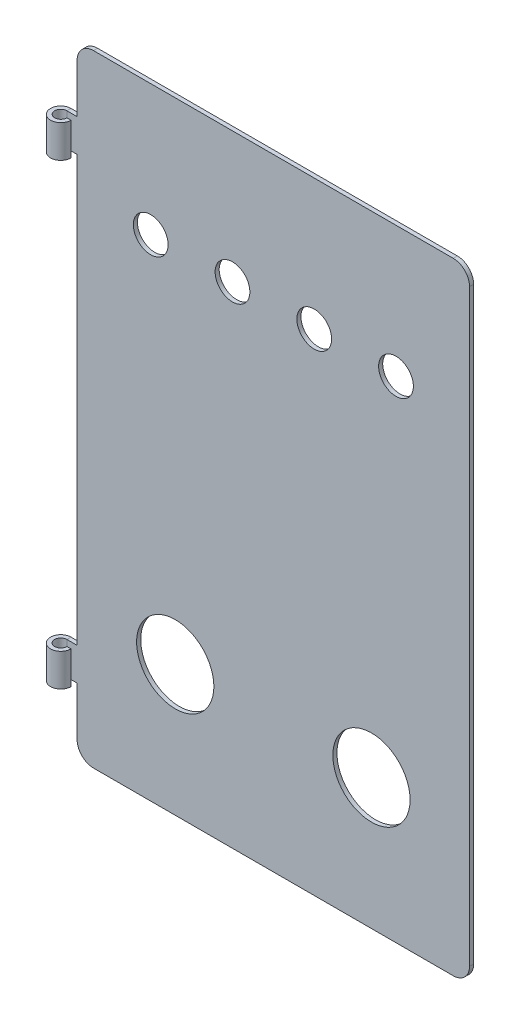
ISO-10303-21;
HEADER;
FILE_DESCRIPTION(('STEP AP214'),'2;1');
FILE_NAME('part.step','',(''),(''),'','','');
FILE_SCHEMA(('AUTOMOTIVE_DESIGN { 1 0 10303 214 1 1 1 1 }'));
ENDSEC;
DATA;
#1=APPLICATION_CONTEXT('core data for automotive mechanical design processes');
#2=APPLICATION_PROTOCOL_DEFINITION('international standard','automotive_design',2000,#1);
#3=PRODUCT_CONTEXT('',#1,'mechanical');
#4=PRODUCT('Part','Part','',(#3));
#5=PRODUCT_RELATED_PRODUCT_CATEGORY('part','',(#4));
#6=PRODUCT_DEFINITION_FORMATION('','',#4);
#7=PRODUCT_DEFINITION_CONTEXT('part definition',#1,'design');
#8=PRODUCT_DEFINITION('design','',#6,#7);
#9=PRODUCT_DEFINITION_SHAPE('','',#8);
#10=(LENGTH_UNIT() NAMED_UNIT(*) SI_UNIT(.MILLI.,.METRE.));
#11=(NAMED_UNIT(*) PLANE_ANGLE_UNIT() SI_UNIT($,.RADIAN.));
#12=(NAMED_UNIT(*) SI_UNIT($,.STERADIAN.) SOLID_ANGLE_UNIT());
#13=UNCERTAINTY_MEASURE_WITH_UNIT(LENGTH_MEASURE(1.E-05),#10,'distance_accuracy_value','');
#14=(GEOMETRIC_REPRESENTATION_CONTEXT(3) GLOBAL_UNCERTAINTY_ASSIGNED_CONTEXT((#13)) GLOBAL_UNIT_ASSIGNED_CONTEXT((#10,
#11,#12)) REPRESENTATION_CONTEXT('',''));
#15=CARTESIAN_POINT('',(0.,0.,0.));
#16=DIRECTION('',(0.,0.,1.));
#17=DIRECTION('',(1.,0.,0.));
#18=AXIS2_PLACEMENT_3D('',#15,#16,#17);
#19=CARTESIAN_POINT('',(-76.2000000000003,-120.65,1.5875));
#20=DIRECTION('',(1.,0.,0.));
#21=DIRECTION('',(0.,0.,-1.));
#22=AXIS2_PLACEMENT_3D('',#19,#20,#21);
#23=PLANE('',#22);
#24=DIRECTION('',(0.,-1.,0.));
#25=VECTOR('',#24,1.);
#26=CARTESIAN_POINT('',(-76.2000000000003,-120.65,1.5875));
#27=LINE('',#26,#25);
#28=CARTESIAN_POINT('',(-76.2000000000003,-95.2500000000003,1.5875));
#29=VERTEX_POINT('',#28);
#30=CARTESIAN_POINT('',(-76.2000000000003,-114.3,1.5875));
#31=VERTEX_POINT('',#30);
#32=EDGE_CURVE('E52',#29,#31,#27,.T.);
#33=ORIENTED_EDGE('',*,*,#32,.F.);
#34=DIRECTION('',(0.,0.,1.));
#35=VECTOR('',#34,1.);
#36=CARTESIAN_POINT('',(-76.2000000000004,-95.2500000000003,0.));
#37=LINE('',#36,#35);
#38=CARTESIAN_POINT('',(-76.2000000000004,-95.2500000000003,0.));
#39=VERTEX_POINT('',#38);
#40=EDGE_CURVE('E251',#39,#29,#37,.T.);
#41=ORIENTED_EDGE('',*,*,#40,.F.);
#42=DIRECTION('',(0.,-1.,0.));
#43=VECTOR('',#42,1.);
#44=CARTESIAN_POINT('',(-76.2000000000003,-120.65,0.));
#45=LINE('',#44,#43);
#46=CARTESIAN_POINT('',(-76.2000000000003,-114.3,0.));
#47=VERTEX_POINT('',#46);
#48=EDGE_CURVE('E307',#39,#47,#45,.T.);
#49=ORIENTED_EDGE('',*,*,#48,.T.);
#50=DIRECTION('',(0.,0.,-1.));
#51=VECTOR('',#50,1.);
#52=CARTESIAN_POINT('',(-76.2000000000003,-114.3,1.5875));
#53=LINE('',#52,#51);
#54=EDGE_CURVE('E342',#47,#31,#53,.F.);
#55=ORIENTED_EDGE('',*,*,#54,.T.);
#56=EDGE_LOOP('',(#33,#41,#49,#55));
#57=FACE_BOUND('',#56,.T.);
#58=ADVANCED_FACE('F37',(#57),#23,.F.);
#59=CARTESIAN_POINT('',(-76.2000000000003,82.5500000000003,0.));
#60=VERTEX_POINT('',#59);
#61=CARTESIAN_POINT('',(-76.2000000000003,-82.5500000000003,0.));
#62=VERTEX_POINT('',#61);
#63=EDGE_CURVE('E310',#60,#62,#45,.T.);
#64=ORIENTED_EDGE('',*,*,#63,.T.);
#65=DIRECTION('',(0.,0.,1.));
#66=VECTOR('',#65,1.);
#67=CARTESIAN_POINT('',(-76.2000000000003,-82.5500000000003,0.));
#68=LINE('',#67,#66);
#69=CARTESIAN_POINT('',(-76.2000000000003,-82.5500000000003,1.5875));
#70=VERTEX_POINT('',#69);
#71=EDGE_CURVE('E60',#62,#70,#68,.T.);
#72=ORIENTED_EDGE('',*,*,#71,.T.);
#73=CARTESIAN_POINT('',(-76.2000000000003,82.5500000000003,1.5875));
#74=VERTEX_POINT('',#73);
#75=EDGE_CURVE('E298',#74,#70,#27,.T.);
#76=ORIENTED_EDGE('',*,*,#75,.F.);
#77=DIRECTION('',(0.,0.,1.));
#78=VECTOR('',#77,1.);
#79=CARTESIAN_POINT('',(-76.2000000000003,82.5500000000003,0.));
#80=LINE('',#79,#78);
#81=EDGE_CURVE('E277',#60,#74,#80,.T.);
#82=ORIENTED_EDGE('',*,*,#81,.F.);
#83=EDGE_LOOP('',(#64,#72,#76,#82));
#84=FACE_BOUND('',#83,.T.);
#85=ADVANCED_FACE('F393',(#84),#23,.F.);
#86=CARTESIAN_POINT('',(76.2000000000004,-120.65,1.5875));
#87=DIRECTION('',(-1.,0.,0.));
#88=DIRECTION('',(0.,0.,1.));
#89=AXIS2_PLACEMENT_3D('',#86,#87,#88);
#90=PLANE('',#89);
#91=DIRECTION('',(0.,1.,0.));
#92=VECTOR('',#91,1.);
#93=CARTESIAN_POINT('',(76.2000000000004,-120.65,1.5875));
#94=LINE('',#93,#92);
#95=CARTESIAN_POINT('',(76.2000000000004,-114.3,1.5875));
#96=VERTEX_POINT('',#95);
#97=CARTESIAN_POINT('',(76.2000000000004,114.3,1.5875));
#98=VERTEX_POINT('',#97);
#99=EDGE_CURVE('E287',#96,#98,#94,.T.);
#100=ORIENTED_EDGE('',*,*,#99,.F.);
#101=DIRECTION('',(0.,0.,-1.));
#102=VECTOR('',#101,1.);
#103=CARTESIAN_POINT('',(76.2000000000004,-114.3,1.5875));
#104=LINE('',#103,#102);
#105=CARTESIAN_POINT('',(76.2000000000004,-114.3,0.));
#106=VERTEX_POINT('',#105);
#107=EDGE_CURVE('E314',#96,#106,#104,.T.);
#108=ORIENTED_EDGE('',*,*,#107,.T.);
#109=DIRECTION('',(0.,1.,0.));
#110=VECTOR('',#109,1.);
#111=CARTESIAN_POINT('',(76.2000000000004,-120.65,0.));
#112=LINE('',#111,#110);
#113=CARTESIAN_POINT('',(76.2000000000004,114.3,0.));
#114=VERTEX_POINT('',#113);
#115=EDGE_CURVE('E280',#106,#114,#112,.T.);
#116=ORIENTED_EDGE('',*,*,#115,.T.);
#117=DIRECTION('',(0.,0.,-1.));
#118=VECTOR('',#117,1.);
#119=CARTESIAN_POINT('',(76.2000000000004,114.3,1.5875));
#120=LINE('',#119,#118);
#121=EDGE_CURVE('E301',#114,#98,#120,.F.);
#122=ORIENTED_EDGE('',*,*,#121,.T.);
#123=EDGE_LOOP('',(#100,#108,#116,#122));
#124=FACE_BOUND('',#123,.T.);
#125=ADVANCED_FACE('F411',(#124),#90,.F.);
#126=CARTESIAN_POINT('',(-76.2000000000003,120.65,1.5875));
#127=DIRECTION('',(0.,-1.,0.));
#128=DIRECTION('',(0.,0.,-1.));
#129=AXIS2_PLACEMENT_3D('',#126,#127,#128);
#130=PLANE('',#129);
#131=DIRECTION('',(-1.,0.,0.));
#132=VECTOR('',#131,1.);
#133=CARTESIAN_POINT('',(-76.2000000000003,120.65,0.));
#134=LINE('',#133,#132);
#135=CARTESIAN_POINT('',(69.8500000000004,120.65,0.));
#136=VERTEX_POINT('',#135);
#137=CARTESIAN_POINT('',(-69.8500000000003,120.65,0.));
#138=VERTEX_POINT('',#137);
#139=EDGE_CURVE('E304',#136,#138,#134,.T.);
#140=ORIENTED_EDGE('',*,*,#139,.T.);
#141=DIRECTION('',(0.,0.,-1.));
#142=VECTOR('',#141,1.);
#143=CARTESIAN_POINT('',(-69.8500000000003,120.65,1.5875));
#144=LINE('',#143,#142);
#145=CARTESIAN_POINT('',(-69.8500000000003,120.65,1.5875));
#146=VERTEX_POINT('',#145);
#147=EDGE_CURVE('E11',#138,#146,#144,.F.);
#148=ORIENTED_EDGE('',*,*,#147,.T.);
#149=DIRECTION('',(-1.,0.,0.));
#150=VECTOR('',#149,1.);
#151=CARTESIAN_POINT('',(-76.2000000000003,120.65,1.5875));
#152=LINE('',#151,#150);
#153=CARTESIAN_POINT('',(69.8500000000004,120.65,1.5875));
#154=VERTEX_POINT('',#153);
#155=EDGE_CURVE('E290',#154,#146,#152,.T.);
#156=ORIENTED_EDGE('',*,*,#155,.F.);
#157=DIRECTION('',(0.,0.,-1.));
#158=VECTOR('',#157,1.);
#159=CARTESIAN_POINT('',(69.8500000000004,120.65,1.5875));
#160=LINE('',#159,#158);
#161=EDGE_CURVE('E45',#154,#136,#160,.T.);
#162=ORIENTED_EDGE('',*,*,#161,.T.);
#163=EDGE_LOOP('',(#140,#148,#156,#162));
#164=FACE_BOUND('',#163,.T.);
#165=ADVANCED_FACE('F348',(#164),#130,.F.);
#166=CARTESIAN_POINT('',(-76.2000000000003,114.3,0.));
#167=VERTEX_POINT('',#166);
#168=CARTESIAN_POINT('',(-76.2000000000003,95.2500000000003,0.));
#169=VERTEX_POINT('',#168);
#170=EDGE_CURVE('E308',#167,#169,#45,.T.);
#171=ORIENTED_EDGE('',*,*,#170,.T.);
#172=DIRECTION('',(0.,0.,1.));
#173=VECTOR('',#172,1.);
#174=CARTESIAN_POINT('',(-76.2000000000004,95.2500000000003,0.));
#175=LINE('',#174,#173);
#176=CARTESIAN_POINT('',(-76.2000000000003,95.2500000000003,1.5875));
#177=VERTEX_POINT('',#176);
#178=EDGE_CURVE('E269',#169,#177,#175,.T.);
#179=ORIENTED_EDGE('',*,*,#178,.T.);
#180=CARTESIAN_POINT('',(-76.2000000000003,114.3,1.5875));
#181=VERTEX_POINT('',#180);
#182=EDGE_CURVE('E294',#181,#177,#27,.T.);
#183=ORIENTED_EDGE('',*,*,#182,.F.);
#184=DIRECTION('',(0.,0.,-1.));
#185=VECTOR('',#184,1.);
#186=CARTESIAN_POINT('',(-76.2000000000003,114.3,1.5875));
#187=LINE('',#186,#185);
#188=EDGE_CURVE('E339',#181,#167,#187,.T.);
#189=ORIENTED_EDGE('',*,*,#188,.T.);
#190=EDGE_LOOP('',(#171,#179,#183,#189));
#191=FACE_BOUND('',#190,.T.);
#192=ADVANCED_FACE('F363',(#191),#23,.F.);
#193=CARTESIAN_POINT('',(-76.2000000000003,-120.65,1.5875));
#194=DIRECTION('',(0.,1.,0.));
#195=DIRECTION('',(0.,0.,1.));
#196=AXIS2_PLACEMENT_3D('',#193,#194,#195);
#197=PLANE('',#196);
#198=DIRECTION('',(1.,0.,0.));
#199=VECTOR('',#198,1.);
#200=CARTESIAN_POINT('',(-76.2000000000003,-120.65,0.));
#201=LINE('',#200,#199);
#202=CARTESIAN_POINT('',(-69.8500000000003,-120.65,0.));
#203=VERTEX_POINT('',#202);
#204=CARTESIAN_POINT('',(69.8500000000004,-120.65,0.));
#205=VERTEX_POINT('',#204);
#206=EDGE_CURVE('E291',#203,#205,#201,.T.);
#207=ORIENTED_EDGE('',*,*,#206,.T.);
#208=DIRECTION('',(0.,0.,-1.));
#209=VECTOR('',#208,1.);
#210=CARTESIAN_POINT('',(69.8500000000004,-120.65,1.5875));
#211=LINE('',#210,#209);
#212=CARTESIAN_POINT('',(69.8500000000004,-120.65,1.5875));
#213=VERTEX_POINT('',#212);
#214=EDGE_CURVE('E329',#205,#213,#211,.F.);
#215=ORIENTED_EDGE('',*,*,#214,.T.);
#216=DIRECTION('',(1.,0.,0.));
#217=VECTOR('',#216,1.);
#218=CARTESIAN_POINT('',(-76.2000000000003,-120.65,1.5875));
#219=LINE('',#218,#217);
#220=CARTESIAN_POINT('',(-69.8500000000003,-120.65,1.5875));
#221=VERTEX_POINT('',#220);
#222=EDGE_CURVE('E297',#221,#213,#219,.T.);
#223=ORIENTED_EDGE('',*,*,#222,.F.);
#224=DIRECTION('',(0.,0.,-1.));
#225=VECTOR('',#224,1.);
#226=CARTESIAN_POINT('',(-69.8500000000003,-120.65,1.5875));
#227=LINE('',#226,#225);
#228=EDGE_CURVE('E326',#221,#203,#227,.T.);
#229=ORIENTED_EDGE('',*,*,#228,.T.);
#230=EDGE_LOOP('',(#207,#215,#223,#229));
#231=FACE_BOUND('',#230,.T.);
#232=ADVANCED_FACE('F403',(#231),#197,.F.);
#233=CARTESIAN_POINT('',(76.2000000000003,120.65,1.5875));
#234=DIRECTION('',(0.,0.,-1.));
#235=DIRECTION('',(-1.,0.,0.));
#236=AXIS2_PLACEMENT_3D('',#233,#234,#235);
#237=PLANE('',#236);
#238=CARTESIAN_POINT('',(47.625,69.8500000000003,1.5875));
#239=DIRECTION('',(0.,0.,1.));
#240=DIRECTION('',(1.,0.,0.));
#241=AXIS2_PLACEMENT_3D('',#238,#239,#240);
#242=CIRCLE('',#241,6.746875);
#243=CARTESIAN_POINT('',(54.371875,69.8500000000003,1.5875));
#244=VERTEX_POINT('',#243);
#245=EDGE_CURVE('E720',#244,#244,#242,.T.);
#246=ORIENTED_EDGE('',*,*,#245,.F.);
#247=EDGE_LOOP('',(#246));
#248=FACE_BOUND('',#247,.T.);
#249=CARTESIAN_POINT('',(15.875,69.8500000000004,1.5875));
#250=DIRECTION('',(0.,0.,1.));
#251=DIRECTION('',(1.,0.,0.));
#252=AXIS2_PLACEMENT_3D('',#249,#250,#251);
#253=CIRCLE('',#252,6.74687499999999);
#254=CARTESIAN_POINT('',(22.621875,69.8500000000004,1.5875));
#255=VERTEX_POINT('',#254);
#256=EDGE_CURVE('E722',#255,#255,#253,.T.);
#257=ORIENTED_EDGE('',*,*,#256,.F.);
#258=EDGE_LOOP('',(#257));
#259=FACE_BOUND('',#258,.T.);
#260=CARTESIAN_POINT('',(-15.875,69.8500000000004,1.5875));
#261=DIRECTION('',(0.,0.,1.));
#262=DIRECTION('',(1.,0.,0.));
#263=AXIS2_PLACEMENT_3D('',#260,#261,#262);
#264=CIRCLE('',#263,6.746875);
#265=CARTESIAN_POINT('',(-9.128125,69.8500000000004,1.5875));
#266=VERTEX_POINT('',#265);
#267=EDGE_CURVE('E728',#266,#266,#264,.T.);
#268=ORIENTED_EDGE('',*,*,#267,.F.);
#269=EDGE_LOOP('',(#268));
#270=FACE_BOUND('',#269,.T.);
#271=CARTESIAN_POINT('',(-47.625,69.8500000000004,1.5875));
#272=DIRECTION('',(0.,0.,1.));
#273=DIRECTION('',(1.,0.,0.));
#274=AXIS2_PLACEMENT_3D('',#271,#272,#273);
#275=CIRCLE('',#274,6.746875);
#276=CARTESIAN_POINT('',(-40.878125,69.8500000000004,1.5875));
#277=VERTEX_POINT('',#276);
#278=EDGE_CURVE('E734',#277,#277,#275,.T.);
#279=ORIENTED_EDGE('',*,*,#278,.F.);
#280=EDGE_LOOP('',(#279));
#281=FACE_BOUND('',#280,.T.);
#282=CARTESIAN_POINT('',(38.1,-69.8500000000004,1.5875));
#283=DIRECTION('',(0.,0.,1.));
#284=DIRECTION('',(1.,0.,0.));
#285=AXIS2_PLACEMENT_3D('',#282,#283,#284);
#286=CIRCLE('',#285,15.);
#287=CARTESIAN_POINT('',(53.1,-69.8500000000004,1.5875));
#288=VERTEX_POINT('',#287);
#289=EDGE_CURVE('E740',#288,#288,#286,.T.);
#290=ORIENTED_EDGE('',*,*,#289,.F.);
#291=EDGE_LOOP('',(#290));
#292=FACE_BOUND('',#291,.T.);
#293=CARTESIAN_POINT('',(-38.1,-69.8500000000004,1.5875));
#294=DIRECTION('',(0.,0.,1.));
#295=DIRECTION('',(1.,0.,0.));
#296=AXIS2_PLACEMENT_3D('',#293,#294,#295);
#297=CIRCLE('',#296,15.);
#298=CARTESIAN_POINT('',(-23.1,-69.8500000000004,1.5875));
#299=VERTEX_POINT('',#298);
#300=EDGE_CURVE('E202',#299,#299,#297,.T.);
#301=ORIENTED_EDGE('',*,*,#300,.F.);
#302=EDGE_LOOP('',(#301));
#303=FACE_BOUND('',#302,.T.);
#304=ORIENTED_EDGE('',*,*,#222,.T.);
#305=CARTESIAN_POINT('',(69.8500000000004,-114.3,1.5875));
#306=DIRECTION('',(0.,0.,-1.));
#307=DIRECTION('',(-1.,0.,0.));
#308=AXIS2_PLACEMENT_3D('',#305,#306,#307);
#309=CIRCLE('',#308,6.35);
#310=EDGE_CURVE('E337',#213,#96,#309,.F.);
#311=ORIENTED_EDGE('',*,*,#310,.T.);
#312=ORIENTED_EDGE('',*,*,#99,.T.);
#313=CARTESIAN_POINT('',(69.8500000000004,114.3,1.5875));
#314=DIRECTION('',(0.,0.,-1.));
#315=DIRECTION('',(-1.,0.,0.));
#316=AXIS2_PLACEMENT_3D('',#313,#314,#315);
#317=CIRCLE('',#316,6.35);
#318=EDGE_CURVE('E331',#98,#154,#317,.F.);
#319=ORIENTED_EDGE('',*,*,#318,.T.);
#320=ORIENTED_EDGE('',*,*,#155,.T.);
#321=CARTESIAN_POINT('',(-69.8500000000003,114.3,1.5875));
#322=DIRECTION('',(0.,0.,-1.));
#323=DIRECTION('',(-1.,0.,0.));
#324=AXIS2_PLACEMENT_3D('',#321,#322,#323);
#325=CIRCLE('',#324,6.35);
#326=EDGE_CURVE('E333',#146,#181,#325,.F.);
#327=ORIENTED_EDGE('',*,*,#326,.T.);
#328=ORIENTED_EDGE('',*,*,#182,.T.);
#329=DIRECTION('',(-1.,0.,0.));
#330=VECTOR('',#329,1.);
#331=CARTESIAN_POINT('',(-76.2000000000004,95.2500000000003,1.5875));
#332=LINE('',#331,#330);
#333=CARTESIAN_POINT('',(-80.16875,95.2500000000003,1.5875));
#334=VERTEX_POINT('',#333);
#335=EDGE_CURVE('E253',#177,#334,#332,.T.);
#336=ORIENTED_EDGE('',*,*,#335,.T.);
#337=DIRECTION('',(0.,-1.,0.));
#338=VECTOR('',#337,1.);
#339=CARTESIAN_POINT('',(-80.16875,95.2500000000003,1.5875));
#340=LINE('',#339,#338);
#341=CARTESIAN_POINT('',(-80.16875,82.5500000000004,1.58750000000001));
#342=VERTEX_POINT('',#341);
#343=EDGE_CURVE('E272',#334,#342,#340,.T.);
#344=ORIENTED_EDGE('',*,*,#343,.T.);
#345=DIRECTION('',(1.,0.,0.));
#346=VECTOR('',#345,1.);
#347=CARTESIAN_POINT('',(-76.2000000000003,82.5500000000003,1.5875));
#348=LINE('',#347,#346);
#349=EDGE_CURVE('E263',#342,#74,#348,.T.);
#350=ORIENTED_EDGE('',*,*,#349,.T.);
#351=ORIENTED_EDGE('',*,*,#75,.T.);
#352=DIRECTION('',(-1.,0.,0.));
#353=VECTOR('',#352,1.);
#354=CARTESIAN_POINT('',(-76.2000000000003,-82.5500000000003,1.5875));
#355=LINE('',#354,#353);
#356=CARTESIAN_POINT('',(-80.16875,-82.5500000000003,1.5875));
#357=VERTEX_POINT('',#356);
#358=EDGE_CURVE('E234',#70,#357,#355,.T.);
#359=ORIENTED_EDGE('',*,*,#358,.T.);
#360=DIRECTION('',(0.,-1.,0.));
#361=VECTOR('',#360,1.);
#362=CARTESIAN_POINT('',(-80.16875,-95.2500000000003,1.5875));
#363=LINE('',#362,#361);
#364=CARTESIAN_POINT('',(-80.16875,-95.2500000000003,1.58750000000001));
#365=VERTEX_POINT('',#364);
#366=EDGE_CURVE('E246',#357,#365,#363,.T.);
#367=ORIENTED_EDGE('',*,*,#366,.T.);
#368=DIRECTION('',(1.,0.,0.));
#369=VECTOR('',#368,1.);
#370=CARTESIAN_POINT('',(-76.2000000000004,-95.2500000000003,1.5875));
#371=LINE('',#370,#369);
#372=EDGE_CURVE('E239',#365,#29,#371,.T.);
#373=ORIENTED_EDGE('',*,*,#372,.T.);
#374=ORIENTED_EDGE('',*,*,#32,.T.);
#375=CARTESIAN_POINT('',(-69.8500000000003,-114.3,1.5875));
#376=DIRECTION('',(0.,0.,-1.));
#377=DIRECTION('',(-1.,0.,0.));
#378=AXIS2_PLACEMENT_3D('',#375,#376,#377);
#379=CIRCLE('',#378,6.35);
#380=EDGE_CURVE('E335',#31,#221,#379,.F.);
#381=ORIENTED_EDGE('',*,*,#380,.T.);
#382=EDGE_LOOP('',(#304,#311,#312,#319,#320,#327,#328,#336,#344,#350,#351,#359,#367,#373,#374,#381));
#383=FACE_BOUND('',#382,.T.);
#384=ADVANCED_FACE('F367',(#248,#259,#270,#281,#292,#303,#383),#237,.F.);
#385=CARTESIAN_POINT('',(76.2000000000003,120.65,0.));
#386=DIRECTION('',(0.,0.,-1.));
#387=DIRECTION('',(-1.,0.,0.));
#388=AXIS2_PLACEMENT_3D('',#385,#386,#387);
#389=PLANE('',#388);
#390=CARTESIAN_POINT('',(47.625,69.8500000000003,0.));
#391=DIRECTION('',(0.,0.,1.));
#392=DIRECTION('',(1.,0.,0.));
#393=AXIS2_PLACEMENT_3D('',#390,#391,#392);
#394=CIRCLE('',#393,6.746875);
#395=CARTESIAN_POINT('',(54.371875,69.8500000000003,0.));
#396=VERTEX_POINT('',#395);
#397=EDGE_CURVE('E717',#396,#396,#394,.T.);
#398=ORIENTED_EDGE('',*,*,#397,.T.);
#399=EDGE_LOOP('',(#398));
#400=FACE_BOUND('',#399,.T.);
#401=CARTESIAN_POINT('',(15.875,69.8500000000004,0.));
#402=DIRECTION('',(0.,0.,1.));
#403=DIRECTION('',(1.,0.,0.));
#404=AXIS2_PLACEMENT_3D('',#401,#402,#403);
#405=CIRCLE('',#404,6.74687499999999);
#406=CARTESIAN_POINT('',(22.621875,69.8500000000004,0.));
#407=VERTEX_POINT('',#406);
#408=EDGE_CURVE('E725',#407,#407,#405,.T.);
#409=ORIENTED_EDGE('',*,*,#408,.T.);
#410=EDGE_LOOP('',(#409));
#411=FACE_BOUND('',#410,.T.);
#412=CARTESIAN_POINT('',(-15.875,69.8500000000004,0.));
#413=DIRECTION('',(0.,0.,1.));
#414=DIRECTION('',(1.,0.,0.));
#415=AXIS2_PLACEMENT_3D('',#412,#413,#414);
#416=CIRCLE('',#415,6.746875);
#417=CARTESIAN_POINT('',(-9.128125,69.8500000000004,0.));
#418=VERTEX_POINT('',#417);
#419=EDGE_CURVE('E731',#418,#418,#416,.T.);
#420=ORIENTED_EDGE('',*,*,#419,.T.);
#421=EDGE_LOOP('',(#420));
#422=FACE_BOUND('',#421,.T.);
#423=CARTESIAN_POINT('',(-47.625,69.8500000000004,0.));
#424=DIRECTION('',(0.,0.,1.));
#425=DIRECTION('',(1.,0.,0.));
#426=AXIS2_PLACEMENT_3D('',#423,#424,#425);
#427=CIRCLE('',#426,6.746875);
#428=CARTESIAN_POINT('',(-40.878125,69.8500000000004,0.));
#429=VERTEX_POINT('',#428);
#430=EDGE_CURVE('E737',#429,#429,#427,.T.);
#431=ORIENTED_EDGE('',*,*,#430,.T.);
#432=EDGE_LOOP('',(#431));
#433=FACE_BOUND('',#432,.T.);
#434=CARTESIAN_POINT('',(38.1,-69.8500000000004,0.));
#435=DIRECTION('',(0.,0.,1.));
#436=DIRECTION('',(1.,0.,0.));
#437=AXIS2_PLACEMENT_3D('',#434,#435,#436);
#438=CIRCLE('',#437,15.);
#439=CARTESIAN_POINT('',(53.1,-69.8500000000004,0.));
#440=VERTEX_POINT('',#439);
#441=EDGE_CURVE('E743',#440,#440,#438,.T.);
#442=ORIENTED_EDGE('',*,*,#441,.T.);
#443=EDGE_LOOP('',(#442));
#444=FACE_BOUND('',#443,.T.);
#445=CARTESIAN_POINT('',(-38.1,-69.8500000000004,0.));
#446=DIRECTION('',(0.,0.,1.));
#447=DIRECTION('',(1.,0.,0.));
#448=AXIS2_PLACEMENT_3D('',#445,#446,#447);
#449=CIRCLE('',#448,15.);
#450=CARTESIAN_POINT('',(-23.1,-69.8500000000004,0.));
#451=VERTEX_POINT('',#450);
#452=EDGE_CURVE('E209',#451,#451,#449,.T.);
#453=ORIENTED_EDGE('',*,*,#452,.T.);
#454=EDGE_LOOP('',(#453));
#455=FACE_BOUND('',#454,.T.);
#456=ORIENTED_EDGE('',*,*,#115,.F.);
#457=CARTESIAN_POINT('',(69.8500000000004,-114.3,0.));
#458=DIRECTION('',(0.,0.,-1.));
#459=DIRECTION('',(-1.,0.,0.));
#460=AXIS2_PLACEMENT_3D('',#457,#458,#459);
#461=CIRCLE('',#460,6.35);
#462=EDGE_CURVE('E324',#106,#205,#461,.T.);
#463=ORIENTED_EDGE('',*,*,#462,.T.);
#464=ORIENTED_EDGE('',*,*,#206,.F.);
#465=CARTESIAN_POINT('',(-69.8500000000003,-114.3,0.));
#466=DIRECTION('',(0.,0.,-1.));
#467=DIRECTION('',(-1.,0.,0.));
#468=AXIS2_PLACEMENT_3D('',#465,#466,#467);
#469=CIRCLE('',#468,6.35);
#470=EDGE_CURVE('E321',#203,#47,#469,.T.);
#471=ORIENTED_EDGE('',*,*,#470,.T.);
#472=ORIENTED_EDGE('',*,*,#48,.F.);
#473=DIRECTION('',(1.,0.,0.));
#474=VECTOR('',#473,1.);
#475=CARTESIAN_POINT('',(-76.2000000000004,-95.2500000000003,0.));
#476=LINE('',#475,#474);
#477=CARTESIAN_POINT('',(-80.16875,-95.2500000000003,0.));
#478=VERTEX_POINT('',#477);
#479=EDGE_CURVE('E241',#478,#39,#476,.T.);
#480=ORIENTED_EDGE('',*,*,#479,.F.);
#481=DIRECTION('',(0.,-1.,0.));
#482=VECTOR('',#481,1.);
#483=CARTESIAN_POINT('',(-80.16875,-95.2500000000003,0.));
#484=LINE('',#483,#482);
#485=CARTESIAN_POINT('',(-80.16875,-82.5500000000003,0.));
#486=VERTEX_POINT('',#485);
#487=EDGE_CURVE('E238',#486,#478,#484,.T.);
#488=ORIENTED_EDGE('',*,*,#487,.F.);
#489=DIRECTION('',(-1.,0.,0.));
#490=VECTOR('',#489,1.);
#491=CARTESIAN_POINT('',(-76.2000000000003,-82.5500000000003,0.));
#492=LINE('',#491,#490);
#493=EDGE_CURVE('E235',#62,#486,#492,.T.);
#494=ORIENTED_EDGE('',*,*,#493,.F.);
#495=ORIENTED_EDGE('',*,*,#63,.F.);
#496=DIRECTION('',(1.,0.,0.));
#497=VECTOR('',#496,1.);
#498=CARTESIAN_POINT('',(-76.2000000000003,82.5500000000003,0.));
#499=LINE('',#498,#497);
#500=CARTESIAN_POINT('',(-80.16875,82.5500000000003,0.));
#501=VERTEX_POINT('',#500);
#502=EDGE_CURVE('E266',#501,#60,#499,.T.);
#503=ORIENTED_EDGE('',*,*,#502,.F.);
#504=DIRECTION('',(0.,-1.,0.));
#505=VECTOR('',#504,1.);
#506=CARTESIAN_POINT('',(-80.16875,95.2500000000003,0.));
#507=LINE('',#506,#505);
#508=CARTESIAN_POINT('',(-80.16875,95.2500000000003,0.));
#509=VERTEX_POINT('',#508);
#510=EDGE_CURVE('E262',#509,#501,#507,.T.);
#511=ORIENTED_EDGE('',*,*,#510,.F.);
#512=DIRECTION('',(-1.,0.,0.));
#513=VECTOR('',#512,1.);
#514=CARTESIAN_POINT('',(-76.2000000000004,95.2500000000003,0.));
#515=LINE('',#514,#513);
#516=EDGE_CURVE('E259',#169,#509,#515,.T.);
#517=ORIENTED_EDGE('',*,*,#516,.F.);
#518=ORIENTED_EDGE('',*,*,#170,.F.);
#519=CARTESIAN_POINT('',(-69.8500000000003,114.3,0.));
#520=DIRECTION('',(0.,0.,-1.));
#521=DIRECTION('',(-1.,0.,0.));
#522=AXIS2_PLACEMENT_3D('',#519,#520,#521);
#523=CIRCLE('',#522,6.35);
#524=EDGE_CURVE('E319',#167,#138,#523,.T.);
#525=ORIENTED_EDGE('',*,*,#524,.T.);
#526=ORIENTED_EDGE('',*,*,#139,.F.);
#527=CARTESIAN_POINT('',(69.8500000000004,114.3,0.));
#528=DIRECTION('',(0.,0.,-1.));
#529=DIRECTION('',(-1.,0.,0.));
#530=AXIS2_PLACEMENT_3D('',#527,#528,#529);
#531=CIRCLE('',#530,6.35);
#532=EDGE_CURVE('E317',#136,#114,#531,.T.);
#533=ORIENTED_EDGE('',*,*,#532,.T.);
#534=EDGE_LOOP('',(#456,#463,#464,#471,#472,#480,#488,#494,#495,#503,#511,#517,#518,#525,#526,#533));
#535=FACE_BOUND('',#534,.T.);
#536=ADVANCED_FACE('F354',(#400,#411,#422,#433,#444,#455,#535),#389,.T.);
#537=CARTESIAN_POINT('',(69.8500000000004,-114.3,1.5875));
#538=DIRECTION('',(0.,0.,-1.));
#539=DIRECTION('',(-1.,0.,0.));
#540=AXIS2_PLACEMENT_3D('',#537,#538,#539);
#541=CYLINDRICAL_SURFACE('',#540,6.35);
#542=ORIENTED_EDGE('',*,*,#310,.F.);
#543=ORIENTED_EDGE('',*,*,#214,.F.);
#544=ORIENTED_EDGE('',*,*,#462,.F.);
#545=ORIENTED_EDGE('',*,*,#107,.F.);
#546=EDGE_LOOP('',(#542,#543,#544,#545));
#547=FACE_BOUND('',#546,.T.);
#548=ADVANCED_FACE('F408',(#547),#541,.T.);
#549=CARTESIAN_POINT('',(-69.8500000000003,-114.3,1.5875));
#550=DIRECTION('',(0.,0.,-1.));
#551=DIRECTION('',(-1.,0.,0.));
#552=AXIS2_PLACEMENT_3D('',#549,#550,#551);
#553=CYLINDRICAL_SURFACE('',#552,6.35);
#554=ORIENTED_EDGE('',*,*,#380,.F.);
#555=ORIENTED_EDGE('',*,*,#54,.F.);
#556=ORIENTED_EDGE('',*,*,#470,.F.);
#557=ORIENTED_EDGE('',*,*,#228,.F.);
#558=EDGE_LOOP('',(#554,#555,#556,#557));
#559=FACE_BOUND('',#558,.T.);
#560=ADVANCED_FACE('F400',(#559),#553,.T.);
#561=CARTESIAN_POINT('',(-69.8500000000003,114.3,1.5875));
#562=DIRECTION('',(0.,0.,-1.));
#563=DIRECTION('',(-1.,0.,0.));
#564=AXIS2_PLACEMENT_3D('',#561,#562,#563);
#565=CYLINDRICAL_SURFACE('',#564,6.35);
#566=ORIENTED_EDGE('',*,*,#326,.F.);
#567=ORIENTED_EDGE('',*,*,#147,.F.);
#568=ORIENTED_EDGE('',*,*,#524,.F.);
#569=ORIENTED_EDGE('',*,*,#188,.F.);
#570=EDGE_LOOP('',(#566,#567,#568,#569));
#571=FACE_BOUND('',#570,.T.);
#572=ADVANCED_FACE('F360',(#571),#565,.T.);
#573=CARTESIAN_POINT('',(69.8500000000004,114.3,1.5875));
#574=DIRECTION('',(0.,0.,-1.));
#575=DIRECTION('',(-1.,0.,0.));
#576=AXIS2_PLACEMENT_3D('',#573,#574,#575);
#577=CYLINDRICAL_SURFACE('',#576,6.35);
#578=ORIENTED_EDGE('',*,*,#318,.F.);
#579=ORIENTED_EDGE('',*,*,#121,.F.);
#580=ORIENTED_EDGE('',*,*,#532,.F.);
#581=ORIENTED_EDGE('',*,*,#161,.F.);
#582=EDGE_LOOP('',(#578,#579,#580,#581));
#583=FACE_BOUND('',#582,.T.);
#584=ADVANCED_FACE('F39',(#583),#577,.T.);
#585=CARTESIAN_POINT('',(-76.2000000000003,82.5500000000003,0.));
#586=DIRECTION('',(0.,-1.,0.));
#587=DIRECTION('',(1.,0.,0.));
#588=AXIS2_PLACEMENT_3D('',#585,#586,#587);
#589=PLANE('',#588);
#590=ORIENTED_EDGE('',*,*,#349,.F.);
#591=DIRECTION('',(0.,0.,1.));
#592=VECTOR('',#591,1.);
#593=CARTESIAN_POINT('',(-80.16875,82.5500000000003,0.));
#594=LINE('',#593,#592);
#595=EDGE_CURVE('E281',#501,#342,#594,.T.);
#596=ORIENTED_EDGE('',*,*,#595,.F.);
#597=ORIENTED_EDGE('',*,*,#502,.T.);
#598=ORIENTED_EDGE('',*,*,#81,.T.);
#599=EDGE_LOOP('',(#590,#596,#597,#598));
#600=FACE_BOUND('',#599,.T.);
#601=ADVANCED_FACE('F390',(#600),#589,.T.);
#602=CARTESIAN_POINT('',(-76.2000000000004,95.2500000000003,0.));
#603=DIRECTION('',(0.,1.,0.));
#604=DIRECTION('',(0.,0.,1.));
#605=AXIS2_PLACEMENT_3D('',#602,#603,#604);
#606=PLANE('',#605);
#607=ORIENTED_EDGE('',*,*,#335,.F.);
#608=ORIENTED_EDGE('',*,*,#178,.F.);
#609=ORIENTED_EDGE('',*,*,#516,.T.);
#610=DIRECTION('',(0.,0.,1.));
#611=VECTOR('',#610,1.);
#612=CARTESIAN_POINT('',(-80.16875,95.2500000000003,0.));
#613=LINE('',#612,#611);
#614=EDGE_CURVE('E284',#509,#334,#613,.T.);
#615=ORIENTED_EDGE('',*,*,#614,.T.);
#616=EDGE_LOOP('',(#607,#608,#609,#615));
#617=FACE_BOUND('',#616,.T.);
#618=ADVANCED_FACE('F370',(#617),#606,.T.);
#619=CARTESIAN_POINT('',(-76.2000000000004,-95.2500000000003,0.));
#620=DIRECTION('',(0.,-1.,0.));
#621=DIRECTION('',(0.,0.,-1.));
#622=AXIS2_PLACEMENT_3D('',#619,#620,#621);
#623=PLANE('',#622);
#624=ORIENTED_EDGE('',*,*,#372,.F.);
#625=DIRECTION('',(0.,0.,1.));
#626=VECTOR('',#625,1.);
#627=CARTESIAN_POINT('',(-80.16875,-95.2500000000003,0.));
#628=LINE('',#627,#626);
#629=EDGE_CURVE('E254',#478,#365,#628,.T.);
#630=ORIENTED_EDGE('',*,*,#629,.F.);
#631=ORIENTED_EDGE('',*,*,#479,.T.);
#632=ORIENTED_EDGE('',*,*,#40,.T.);
#633=EDGE_LOOP('',(#624,#630,#631,#632));
#634=FACE_BOUND('',#633,.T.);
#635=ADVANCED_FACE('F490',(#634),#623,.T.);
#636=CARTESIAN_POINT('',(-76.2000000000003,-82.5500000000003,0.));
#637=DIRECTION('',(0.,1.,0.));
#638=DIRECTION('',(-1.,0.,0.));
#639=AXIS2_PLACEMENT_3D('',#636,#637,#638);
#640=PLANE('',#639);
#641=ORIENTED_EDGE('',*,*,#358,.F.);
#642=ORIENTED_EDGE('',*,*,#71,.F.);
#643=ORIENTED_EDGE('',*,*,#493,.T.);
#644=DIRECTION('',(0.,0.,1.));
#645=VECTOR('',#644,1.);
#646=CARTESIAN_POINT('',(-80.16875,-82.5500000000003,0.));
#647=LINE('',#646,#645);
#648=EDGE_CURVE('E198',#486,#357,#647,.T.);
#649=ORIENTED_EDGE('',*,*,#648,.T.);
#650=EDGE_LOOP('',(#641,#642,#643,#649));
#651=FACE_BOUND('',#650,.T.);
#652=ADVANCED_FACE('F500',(#651),#640,.T.);
#653=CARTESIAN_POINT('',(-77.7875,88.9000000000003,3.96874999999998));
#654=DIRECTION('',(0.,0.,1.));
#655=DIRECTION('',(0.,-1.,0.));
#656=AXIS2_PLACEMENT_3D('',#653,#654,#655);
#657=PLANE('',#656);
#658=DIRECTION('',(1.,0.,0.));
#659=VECTOR('',#658,1.);
#660=CARTESIAN_POINT('',(-77.7875,82.5500000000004,3.96874999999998));
#661=LINE('',#660,#659);
#662=CARTESIAN_POINT('',(-77.7875,82.5500000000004,3.96874999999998));
#663=VERTEX_POINT('',#662);
#664=CARTESIAN_POINT('',(-76.2,82.5500000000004,3.96874999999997));
#665=VERTEX_POINT('',#664);
#666=EDGE_CURVE('E232',#663,#665,#661,.T.);
#667=ORIENTED_EDGE('',*,*,#666,.F.);
#668=DIRECTION('',(0.,-1.,0.));
#669=VECTOR('',#668,1.);
#670=CARTESIAN_POINT('',(-77.7875,82.5500000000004,3.96874999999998));
#671=LINE('',#670,#669);
#672=CARTESIAN_POINT('',(-77.7875,95.2500000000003,3.96874999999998));
#673=VERTEX_POINT('',#672);
#674=EDGE_CURVE('E212',#673,#663,#671,.T.);
#675=ORIENTED_EDGE('',*,*,#674,.F.);
#676=DIRECTION('',(1.,0.,0.));
#677=VECTOR('',#676,1.);
#678=CARTESIAN_POINT('',(-77.7875,95.2500000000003,3.96874999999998));
#679=LINE('',#678,#677);
#680=CARTESIAN_POINT('',(-76.2,95.2500000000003,3.96874999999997));
#681=VERTEX_POINT('',#680);
#682=EDGE_CURVE('E216',#673,#681,#679,.T.);
#683=ORIENTED_EDGE('',*,*,#682,.T.);
#684=DIRECTION('',(0.,-1.,0.));
#685=VECTOR('',#684,1.);
#686=CARTESIAN_POINT('',(-76.2,82.5500000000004,3.96874999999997));
#687=LINE('',#686,#685);
#688=EDGE_CURVE('E218',#681,#665,#687,.T.);
#689=ORIENTED_EDGE('',*,*,#688,.T.);
#690=EDGE_LOOP('',(#667,#675,#683,#689));
#691=FACE_BOUND('',#690,.T.);
#692=ADVANCED_FACE('F381',(#691),#657,.F.);
#693=CARTESIAN_POINT('',(-80.16875,95.2500000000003,3.96875));
#694=DIRECTION('',(0.,1.,0.));
#695=DIRECTION('',(0.,0.,1.));
#696=AXIS2_PLACEMENT_3D('',#693,#694,#695);
#697=PLANE('',#696);
#698=ORIENTED_EDGE('',*,*,#682,.F.);
#699=CARTESIAN_POINT('',(-80.16875,95.2500000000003,3.96875));
#700=DIRECTION('',(0.,-1.,0.));
#701=DIRECTION('',(0.,0.,-1.));
#702=AXIS2_PLACEMENT_3D('',#699,#700,#701);
#703=CIRCLE('',#702,2.38124999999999);
#704=EDGE_CURVE('E221',#334,#673,#703,.F.);
#705=ORIENTED_EDGE('',*,*,#704,.F.);
#706=ORIENTED_EDGE('',*,*,#614,.F.);
#707=CARTESIAN_POINT('',(-80.16875,95.2500000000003,3.96875));
#708=DIRECTION('',(0.,-1.,0.));
#709=DIRECTION('',(0.,0.,-1.));
#710=AXIS2_PLACEMENT_3D('',#707,#708,#709);
#711=CIRCLE('',#710,3.96874999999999);
#712=EDGE_CURVE('E213',#509,#681,#711,.F.);
#713=ORIENTED_EDGE('',*,*,#712,.T.);
#714=EDGE_LOOP('',(#698,#705,#706,#713));
#715=FACE_BOUND('',#714,.T.);
#716=ADVANCED_FACE('F375',(#715),#697,.T.);
#717=CARTESIAN_POINT('',(-80.16875,82.5500000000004,3.96875));
#718=DIRECTION('',(0.,1.,0.));
#719=DIRECTION('',(0.,0.,1.));
#720=AXIS2_PLACEMENT_3D('',#717,#718,#719);
#721=PLANE('',#720);
#722=CARTESIAN_POINT('',(-80.16875,82.5500000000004,3.96875));
#723=DIRECTION('',(0.,-1.,0.));
#724=DIRECTION('',(0.,0.,-1.));
#725=AXIS2_PLACEMENT_3D('',#722,#723,#724);
#726=CIRCLE('',#725,2.38124999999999);
#727=EDGE_CURVE('E226',#663,#342,#726,.T.);
#728=ORIENTED_EDGE('',*,*,#727,.F.);
#729=ORIENTED_EDGE('',*,*,#666,.T.);
#730=CARTESIAN_POINT('',(-80.16875,82.5500000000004,3.96875));
#731=DIRECTION('',(0.,-1.,0.));
#732=DIRECTION('',(0.,0.,-1.));
#733=AXIS2_PLACEMENT_3D('',#730,#731,#732);
#734=CIRCLE('',#733,3.96874999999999);
#735=EDGE_CURVE('E217',#665,#501,#734,.T.);
#736=ORIENTED_EDGE('',*,*,#735,.T.);
#737=ORIENTED_EDGE('',*,*,#595,.T.);
#738=EDGE_LOOP('',(#728,#729,#736,#737));
#739=FACE_BOUND('',#738,.T.);
#740=ADVANCED_FACE('F387',(#739),#721,.F.);
#741=CARTESIAN_POINT('',(-80.16875,82.5500000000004,3.96875));
#742=DIRECTION('',(0.,-1.,0.));
#743=DIRECTION('',(1.,0.,0.));
#744=AXIS2_PLACEMENT_3D('',#741,#742,#743);
#745=CYLINDRICAL_SURFACE('',#744,3.96874999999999);
#746=ORIENTED_EDGE('',*,*,#510,.T.);
#747=ORIENTED_EDGE('',*,*,#735,.F.);
#748=ORIENTED_EDGE('',*,*,#688,.F.);
#749=ORIENTED_EDGE('',*,*,#712,.F.);
#750=EDGE_LOOP('',(#746,#747,#748,#749));
#751=FACE_BOUND('',#750,.T.);
#752=ADVANCED_FACE('F378',(#751),#745,.T.);
#753=CARTESIAN_POINT('',(-80.16875,82.5500000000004,3.96875));
#754=DIRECTION('',(0.,-1.,0.));
#755=DIRECTION('',(1.,0.,0.));
#756=AXIS2_PLACEMENT_3D('',#753,#754,#755);
#757=CYLINDRICAL_SURFACE('',#756,2.38124999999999);
#758=ORIENTED_EDGE('',*,*,#343,.F.);
#759=ORIENTED_EDGE('',*,*,#704,.T.);
#760=ORIENTED_EDGE('',*,*,#674,.T.);
#761=ORIENTED_EDGE('',*,*,#727,.T.);
#762=EDGE_LOOP('',(#758,#759,#760,#761));
#763=FACE_BOUND('',#762,.T.);
#764=ADVANCED_FACE('F385',(#763),#757,.F.);
#765=CARTESIAN_POINT('',(-77.7875,-88.9000000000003,3.96874999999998));
#766=DIRECTION('',(0.,0.,1.));
#767=DIRECTION('',(0.,-1.,0.));
#768=AXIS2_PLACEMENT_3D('',#765,#766,#767);
#769=PLANE('',#768);
#770=DIRECTION('',(1.,0.,0.));
#771=VECTOR('',#770,1.);
#772=CARTESIAN_POINT('',(-77.7875,-95.2500000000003,3.96874999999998));
#773=LINE('',#772,#771);
#774=CARTESIAN_POINT('',(-77.7875,-95.2500000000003,3.96874999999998));
#775=VERTEX_POINT('',#774);
#776=CARTESIAN_POINT('',(-76.2,-95.2500000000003,3.96874999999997));
#777=VERTEX_POINT('',#776);
#778=EDGE_CURVE('E184',#775,#777,#773,.T.);
#779=ORIENTED_EDGE('',*,*,#778,.F.);
#780=DIRECTION('',(0.,-1.,0.));
#781=VECTOR('',#780,1.);
#782=CARTESIAN_POINT('',(-77.7875,-95.2500000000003,3.96874999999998));
#783=LINE('',#782,#781);
#784=CARTESIAN_POINT('',(-77.7875,-82.5500000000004,3.96874999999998));
#785=VERTEX_POINT('',#784);
#786=EDGE_CURVE('E179',#785,#775,#783,.T.);
#787=ORIENTED_EDGE('',*,*,#786,.F.);
#788=DIRECTION('',(1.,0.,0.));
#789=VECTOR('',#788,1.);
#790=CARTESIAN_POINT('',(-77.7875,-82.5500000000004,3.96874999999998));
#791=LINE('',#790,#789);
#792=CARTESIAN_POINT('',(-76.2,-82.5500000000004,3.96874999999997));
#793=VERTEX_POINT('',#792);
#794=EDGE_CURVE('E174',#785,#793,#791,.T.);
#795=ORIENTED_EDGE('',*,*,#794,.T.);
#796=DIRECTION('',(0.,-1.,0.));
#797=VECTOR('',#796,1.);
#798=CARTESIAN_POINT('',(-76.2,-95.2500000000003,3.96874999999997));
#799=LINE('',#798,#797);
#800=EDGE_CURVE('E177',#793,#777,#799,.T.);
#801=ORIENTED_EDGE('',*,*,#800,.T.);
#802=EDGE_LOOP('',(#779,#787,#795,#801));
#803=FACE_BOUND('',#802,.T.);
#804=ADVANCED_FACE('F176',(#803),#769,.F.);
#805=CARTESIAN_POINT('',(-80.16875,-82.5500000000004,3.96875));
#806=DIRECTION('',(0.,1.,0.));
#807=DIRECTION('',(0.,0.,1.));
#808=AXIS2_PLACEMENT_3D('',#805,#806,#807);
#809=PLANE('',#808);
#810=ORIENTED_EDGE('',*,*,#794,.F.);
#811=CARTESIAN_POINT('',(-80.16875,-82.5500000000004,3.96875));
#812=DIRECTION('',(0.,-1.,0.));
#813=DIRECTION('',(0.,0.,-1.));
#814=AXIS2_PLACEMENT_3D('',#811,#812,#813);
#815=CIRCLE('',#814,2.38124999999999);
#816=EDGE_CURVE('E194',#357,#785,#815,.F.);
#817=ORIENTED_EDGE('',*,*,#816,.F.);
#818=ORIENTED_EDGE('',*,*,#648,.F.);
#819=CARTESIAN_POINT('',(-80.16875,-82.5500000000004,3.96875));
#820=DIRECTION('',(0.,-1.,0.));
#821=DIRECTION('',(0.,0.,-1.));
#822=AXIS2_PLACEMENT_3D('',#819,#820,#821);
#823=CIRCLE('',#822,3.96874999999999);
#824=EDGE_CURVE('E185',#486,#793,#823,.F.);
#825=ORIENTED_EDGE('',*,*,#824,.T.);
#826=EDGE_LOOP('',(#810,#817,#818,#825));
#827=FACE_BOUND('',#826,.T.);
#828=ADVANCED_FACE('F197',(#827),#809,.T.);
#829=CARTESIAN_POINT('',(-80.16875,-95.2500000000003,3.96875));
#830=DIRECTION('',(0.,1.,0.));
#831=DIRECTION('',(0.,0.,1.));
#832=AXIS2_PLACEMENT_3D('',#829,#830,#831);
#833=PLANE('',#832);
#834=CARTESIAN_POINT('',(-80.16875,-95.2500000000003,3.96875));
#835=DIRECTION('',(0.,-1.,0.));
#836=DIRECTION('',(0.,0.,-1.));
#837=AXIS2_PLACEMENT_3D('',#834,#835,#836);
#838=CIRCLE('',#837,2.38124999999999);
#839=EDGE_CURVE('E206',#775,#365,#838,.T.);
#840=ORIENTED_EDGE('',*,*,#839,.F.);
#841=ORIENTED_EDGE('',*,*,#778,.T.);
#842=CARTESIAN_POINT('',(-80.16875,-95.2500000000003,3.96875));
#843=DIRECTION('',(0.,-1.,0.));
#844=DIRECTION('',(0.,0.,-1.));
#845=AXIS2_PLACEMENT_3D('',#842,#843,#844);
#846=CIRCLE('',#845,3.96874999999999);
#847=EDGE_CURVE('E193',#777,#478,#846,.T.);
#848=ORIENTED_EDGE('',*,*,#847,.T.);
#849=ORIENTED_EDGE('',*,*,#629,.T.);
#850=EDGE_LOOP('',(#840,#841,#848,#849));
#851=FACE_BOUND('',#850,.T.);
#852=ADVANCED_FACE('F575',(#851),#833,.F.);
#853=CARTESIAN_POINT('',(-80.16875,-95.2500000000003,3.96875));
#854=DIRECTION('',(0.,-1.,0.));
#855=DIRECTION('',(1.,0.,0.));
#856=AXIS2_PLACEMENT_3D('',#853,#854,#855);
#857=CYLINDRICAL_SURFACE('',#856,3.96874999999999);
#858=ORIENTED_EDGE('',*,*,#487,.T.);
#859=ORIENTED_EDGE('',*,*,#847,.F.);
#860=ORIENTED_EDGE('',*,*,#800,.F.);
#861=ORIENTED_EDGE('',*,*,#824,.F.);
#862=EDGE_LOOP('',(#858,#859,#860,#861));
#863=FACE_BOUND('',#862,.T.);
#864=ADVANCED_FACE('F191',(#863),#857,.T.);
#865=CARTESIAN_POINT('',(-80.16875,-95.2500000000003,3.96875));
#866=DIRECTION('',(0.,-1.,0.));
#867=DIRECTION('',(1.,0.,0.));
#868=AXIS2_PLACEMENT_3D('',#865,#866,#867);
#869=CYLINDRICAL_SURFACE('',#868,2.38124999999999);
#870=ORIENTED_EDGE('',*,*,#366,.F.);
#871=ORIENTED_EDGE('',*,*,#816,.T.);
#872=ORIENTED_EDGE('',*,*,#786,.T.);
#873=ORIENTED_EDGE('',*,*,#839,.T.);
#874=EDGE_LOOP('',(#870,#871,#872,#873));
#875=FACE_BOUND('',#874,.T.);
#876=ADVANCED_FACE('F587',(#875),#869,.F.);
#877=CARTESIAN_POINT('',(-38.1,-69.8500000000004,0.));
#878=DIRECTION('',(0.,0.,1.));
#879=DIRECTION('',(1.,0.,0.));
#880=AXIS2_PLACEMENT_3D('',#877,#878,#879);
#881=CYLINDRICAL_SURFACE('',#880,15.);
#882=ORIENTED_EDGE('',*,*,#452,.F.);
#883=EDGE_LOOP('',(#882));
#884=FACE_BOUND('',#883,.T.);
#885=ORIENTED_EDGE('',*,*,#300,.T.);
#886=EDGE_LOOP('',(#885));
#887=FACE_BOUND('',#886,.T.);
#888=ADVANCED_FACE('F605',(#884,#887),#881,.F.);
#889=CARTESIAN_POINT('',(38.1,-69.8500000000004,0.));
#890=DIRECTION('',(0.,0.,1.));
#891=DIRECTION('',(1.,0.,0.));
#892=AXIS2_PLACEMENT_3D('',#889,#890,#891);
#893=CYLINDRICAL_SURFACE('',#892,15.);
#894=ORIENTED_EDGE('',*,*,#441,.F.);
#895=EDGE_LOOP('',(#894));
#896=FACE_BOUND('',#895,.T.);
#897=ORIENTED_EDGE('',*,*,#289,.T.);
#898=EDGE_LOOP('',(#897));
#899=FACE_BOUND('',#898,.T.);
#900=ADVANCED_FACE('F616',(#896,#899),#893,.F.);
#901=CARTESIAN_POINT('',(-47.625,69.8500000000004,0.));
#902=DIRECTION('',(0.,0.,1.));
#903=DIRECTION('',(1.,0.,0.));
#904=AXIS2_PLACEMENT_3D('',#901,#902,#903);
#905=CYLINDRICAL_SURFACE('',#904,6.746875);
#906=ORIENTED_EDGE('',*,*,#430,.F.);
#907=EDGE_LOOP('',(#906));
#908=FACE_BOUND('',#907,.T.);
#909=ORIENTED_EDGE('',*,*,#278,.T.);
#910=EDGE_LOOP('',(#909));
#911=FACE_BOUND('',#910,.T.);
#912=ADVANCED_FACE('F627',(#908,#911),#905,.F.);
#913=CARTESIAN_POINT('',(-15.875,69.8500000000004,0.));
#914=DIRECTION('',(0.,0.,1.));
#915=DIRECTION('',(1.,0.,0.));
#916=AXIS2_PLACEMENT_3D('',#913,#914,#915);
#917=CYLINDRICAL_SURFACE('',#916,6.746875);
#918=ORIENTED_EDGE('',*,*,#419,.F.);
#919=EDGE_LOOP('',(#918));
#920=FACE_BOUND('',#919,.T.);
#921=ORIENTED_EDGE('',*,*,#267,.T.);
#922=EDGE_LOOP('',(#921));
#923=FACE_BOUND('',#922,.T.);
#924=ADVANCED_FACE('F655',(#920,#923),#917,.F.);
#925=CARTESIAN_POINT('',(15.875,69.8500000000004,0.));
#926=DIRECTION('',(0.,0.,1.));
#927=DIRECTION('',(1.,0.,0.));
#928=AXIS2_PLACEMENT_3D('',#925,#926,#927);
#929=CYLINDRICAL_SURFACE('',#928,6.74687499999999);
#930=ORIENTED_EDGE('',*,*,#408,.F.);
#931=EDGE_LOOP('',(#930));
#932=FACE_BOUND('',#931,.T.);
#933=ORIENTED_EDGE('',*,*,#256,.T.);
#934=EDGE_LOOP('',(#933));
#935=FACE_BOUND('',#934,.T.);
#936=ADVANCED_FACE('F666',(#932,#935),#929,.F.);
#937=CARTESIAN_POINT('',(47.625,69.8500000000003,0.));
#938=DIRECTION('',(0.,0.,1.));
#939=DIRECTION('',(1.,0.,0.));
#940=AXIS2_PLACEMENT_3D('',#937,#938,#939);
#941=CYLINDRICAL_SURFACE('',#940,6.746875);
#942=ORIENTED_EDGE('',*,*,#397,.F.);
#943=EDGE_LOOP('',(#942));
#944=FACE_BOUND('',#943,.T.);
#945=ORIENTED_EDGE('',*,*,#245,.T.);
#946=EDGE_LOOP('',(#945));
#947=FACE_BOUND('',#946,.T.);
#948=ADVANCED_FACE('F677',(#944,#947),#941,.F.);
#949=CLOSED_SHELL('',(#58,#85,#125,#165,#192,#232,#384,#536,#548,#560,#572,#584,#601,#618,#635,
#652,#692,#716,#740,#752,#764,#804,#828,#852,#864,#876,#888,#900,#912,#924,#936,#948));
#950=MANIFOLD_SOLID_BREP('B2',#949);
#951=ADVANCED_BREP_SHAPE_REPRESENTATION('',(#18,#950),#14);
#952=SHAPE_DEFINITION_REPRESENTATION(#9,#951);
ENDSEC;
END-ISO-10303-21;
